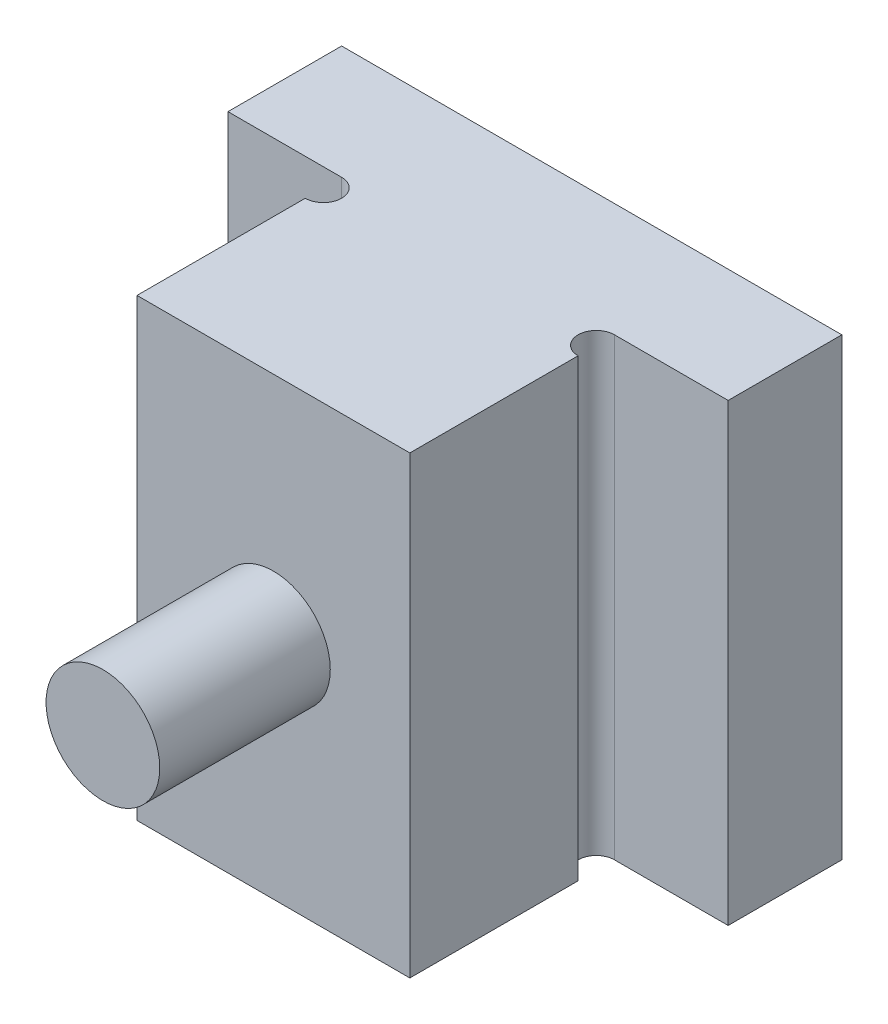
ISO-10303-21;
HEADER;
FILE_DESCRIPTION(('STEP AP214'),'2;1');
FILE_NAME('part.step','',(''),(''),'','','');
FILE_SCHEMA(('AUTOMOTIVE_DESIGN { 1 0 10303 214 1 1 1 1 }'));
ENDSEC;
DATA;
#1=APPLICATION_CONTEXT('core data for automotive mechanical design processes');
#2=APPLICATION_PROTOCOL_DEFINITION('international standard','automotive_design',2000,#1);
#3=PRODUCT_CONTEXT('',#1,'mechanical');
#4=PRODUCT('Part','Part','',(#3));
#5=PRODUCT_RELATED_PRODUCT_CATEGORY('part','',(#4));
#6=PRODUCT_DEFINITION_FORMATION('','',#4);
#7=PRODUCT_DEFINITION_CONTEXT('part definition',#1,'design');
#8=PRODUCT_DEFINITION('design','',#6,#7);
#9=PRODUCT_DEFINITION_SHAPE('','',#8);
#10=(LENGTH_UNIT() NAMED_UNIT(*) SI_UNIT(.MILLI.,.METRE.));
#11=(NAMED_UNIT(*) PLANE_ANGLE_UNIT() SI_UNIT($,.RADIAN.));
#12=(NAMED_UNIT(*) SI_UNIT($,.STERADIAN.) SOLID_ANGLE_UNIT());
#13=UNCERTAINTY_MEASURE_WITH_UNIT(LENGTH_MEASURE(1.E-05),#10,'distance_accuracy_value','');
#14=(GEOMETRIC_REPRESENTATION_CONTEXT(3) GLOBAL_UNCERTAINTY_ASSIGNED_CONTEXT((#13)) GLOBAL_UNIT_ASSIGNED_CONTEXT((#10,
#11,#12)) REPRESENTATION_CONTEXT('',''));
#15=CARTESIAN_POINT('',(0.,0.,0.));
#16=DIRECTION('',(0.,0.,1.));
#17=DIRECTION('',(1.,0.,0.));
#18=AXIS2_PLACEMENT_3D('',#15,#16,#17);
#19=CARTESIAN_POINT('',(-1.15470053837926,2.,-9.95));
#20=DIRECTION('',(0.,0.,1.));
#21=DIRECTION('',(-1.,0.,0.));
#22=AXIS2_PLACEMENT_3D('',#19,#20,#21);
#23=PLANE('',#22);
#24=DIRECTION('',(1.,0.,0.));
#25=VECTOR('',#24,1.);
#26=CARTESIAN_POINT('',(-1.15470053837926,2.,-9.95));
#27=LINE('',#26,#25);
#28=CARTESIAN_POINT('',(-1.15470053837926,2.,-9.95));
#29=VERTEX_POINT('',#28);
#30=CARTESIAN_POINT('',(1.15470053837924,2.,-9.95));
#31=VERTEX_POINT('',#30);
#32=EDGE_CURVE('E127',#29,#31,#27,.T.);
#33=ORIENTED_EDGE('',*,*,#32,.T.);
#34=DIRECTION('',(0.5,-0.866025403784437,0.));
#35=VECTOR('',#34,1.);
#36=CARTESIAN_POINT('',(1.15470053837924,2.,-9.95));
#37=LINE('',#36,#35);
#38=CARTESIAN_POINT('',(2.3094010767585,0.,-9.95));
#39=VERTEX_POINT('',#38);
#40=EDGE_CURVE('E132',#31,#39,#37,.T.);
#41=ORIENTED_EDGE('',*,*,#40,.T.);
#42=DIRECTION('',(0.5,0.866025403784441,0.));
#43=VECTOR('',#42,1.);
#44=CARTESIAN_POINT('',(1.15470053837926,-2.,-9.95));
#45=LINE('',#44,#43);
#46=CARTESIAN_POINT('',(1.15470053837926,-2.,-9.95));
#47=VERTEX_POINT('',#46);
#48=EDGE_CURVE('E183',#47,#39,#45,.T.);
#49=ORIENTED_EDGE('',*,*,#48,.F.);
#50=DIRECTION('',(1.,0.,0.));
#51=VECTOR('',#50,1.);
#52=CARTESIAN_POINT('',(-1.15470053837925,-2.,-9.95));
#53=LINE('',#52,#51);
#54=CARTESIAN_POINT('',(-1.15470053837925,-2.,-9.95));
#55=VERTEX_POINT('',#54);
#56=EDGE_CURVE('E148',#55,#47,#53,.T.);
#57=ORIENTED_EDGE('',*,*,#56,.F.);
#58=DIRECTION('',(-0.5,0.866025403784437,0.));
#59=VECTOR('',#58,1.);
#60=CARTESIAN_POINT('',(-1.15470053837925,-2.,-9.95));
#61=LINE('',#60,#59);
#62=CARTESIAN_POINT('',(-2.30940107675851,0.,-9.95));
#63=VERTEX_POINT('',#62);
#64=EDGE_CURVE('E143',#55,#63,#61,.T.);
#65=ORIENTED_EDGE('',*,*,#64,.T.);
#66=DIRECTION('',(-0.5,-0.866025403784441,0.));
#67=VECTOR('',#66,1.);
#68=CARTESIAN_POINT('',(-1.15470053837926,2.,-9.95));
#69=LINE('',#68,#67);
#70=EDGE_CURVE('E145',#29,#63,#69,.T.);
#71=ORIENTED_EDGE('',*,*,#70,.F.);
#72=EDGE_LOOP('',(#33,#41,#49,#57,#65,#71));
#73=FACE_BOUND('',#72,.T.);
#74=ADVANCED_FACE('F16',(#73),#23,.F.);
#75=CARTESIAN_POINT('',(-1.15470053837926,2.,-9.95));
#76=DIRECTION('',(0.866025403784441,-0.5,0.));
#77=DIRECTION('',(-0.5,-0.866025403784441,0.));
#78=AXIS2_PLACEMENT_3D('',#75,#76,#77);
#79=PLANE('',#78);
#80=ORIENTED_EDGE('',*,*,#70,.T.);
#81=DIRECTION('',(0.,0.,-1.));
#82=VECTOR('',#81,1.);
#83=CARTESIAN_POINT('',(-2.30940107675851,0.,-9.95));
#84=LINE('',#83,#82);
#85=CARTESIAN_POINT('',(-2.30940107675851,0.,-13.5));
#86=VERTEX_POINT('',#85);
#87=EDGE_CURVE('E154',#63,#86,#84,.T.);
#88=ORIENTED_EDGE('',*,*,#87,.T.);
#89=DIRECTION('',(0.5,0.86602540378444,0.));
#90=VECTOR('',#89,1.);
#91=CARTESIAN_POINT('',(-2.30940107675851,0.,-13.5));
#92=LINE('',#91,#90);
#93=CARTESIAN_POINT('',(-1.15470053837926,2.,-13.5));
#94=VERTEX_POINT('',#93);
#95=EDGE_CURVE('E199',#86,#94,#92,.T.);
#96=ORIENTED_EDGE('',*,*,#95,.T.);
#97=DIRECTION('',(0.,0.,-1.));
#98=VECTOR('',#97,1.);
#99=CARTESIAN_POINT('',(-1.15470053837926,2.,-9.95));
#100=LINE('',#99,#98);
#101=EDGE_CURVE('E151',#94,#29,#100,.F.);
#102=ORIENTED_EDGE('',*,*,#101,.T.);
#103=EDGE_LOOP('',(#80,#88,#96,#102));
#104=FACE_BOUND('',#103,.T.);
#105=ADVANCED_FACE('F162',(#104),#79,.T.);
#106=CARTESIAN_POINT('',(-1.15470053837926,2.,-9.95));
#107=DIRECTION('',(0.,1.,0.));
#108=DIRECTION('',(1.,0.,0.));
#109=AXIS2_PLACEMENT_3D('',#106,#107,#108);
#110=PLANE('',#109);
#111=DIRECTION('',(0.,0.,-1.));
#112=VECTOR('',#111,1.);
#113=CARTESIAN_POINT('',(1.15470053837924,2.,-9.95));
#114=LINE('',#113,#112);
#115=CARTESIAN_POINT('',(1.15470053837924,2.,-13.5));
#116=VERTEX_POINT('',#115);
#117=EDGE_CURVE('E189',#116,#31,#114,.F.);
#118=ORIENTED_EDGE('',*,*,#117,.T.);
#119=ORIENTED_EDGE('',*,*,#32,.F.);
#120=ORIENTED_EDGE('',*,*,#101,.F.);
#121=DIRECTION('',(-1.,0.,0.));
#122=VECTOR('',#121,1.);
#123=CARTESIAN_POINT('',(0.,2.,-13.5));
#124=LINE('',#123,#122);
#125=EDGE_CURVE('E160',#94,#116,#124,.F.);
#126=ORIENTED_EDGE('',*,*,#125,.T.);
#127=EDGE_LOOP('',(#118,#119,#120,#126));
#128=FACE_BOUND('',#127,.T.);
#129=ADVANCED_FACE('F344',(#128),#110,.F.);
#130=CARTESIAN_POINT('',(1.15470053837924,2.,-9.95));
#131=DIRECTION('',(0.866025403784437,0.5,0.));
#132=DIRECTION('',(0.5,-0.866025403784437,0.));
#133=AXIS2_PLACEMENT_3D('',#130,#131,#132);
#134=PLANE('',#133);
#135=DIRECTION('',(0.,0.,-1.));
#136=VECTOR('',#135,1.);
#137=CARTESIAN_POINT('',(2.3094010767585,0.,-9.95));
#138=LINE('',#137,#136);
#139=CARTESIAN_POINT('',(2.3094010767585,0.,-13.5));
#140=VERTEX_POINT('',#139);
#141=EDGE_CURVE('E179',#39,#140,#138,.T.);
#142=ORIENTED_EDGE('',*,*,#141,.F.);
#143=ORIENTED_EDGE('',*,*,#40,.F.);
#144=ORIENTED_EDGE('',*,*,#117,.F.);
#145=DIRECTION('',(0.5,-0.866025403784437,0.));
#146=VECTOR('',#145,1.);
#147=CARTESIAN_POINT('',(1.15470053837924,2.,-13.5));
#148=LINE('',#147,#146);
#149=EDGE_CURVE('E648',#116,#140,#148,.T.);
#150=ORIENTED_EDGE('',*,*,#149,.T.);
#151=EDGE_LOOP('',(#142,#143,#144,#150));
#152=FACE_BOUND('',#151,.T.);
#153=ADVANCED_FACE('F524',(#152),#134,.F.);
#154=CARTESIAN_POINT('',(1.15470053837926,-2.,-9.95));
#155=DIRECTION('',(-0.866025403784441,0.5,0.));
#156=DIRECTION('',(0.5,0.866025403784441,0.));
#157=AXIS2_PLACEMENT_3D('',#154,#155,#156);
#158=PLANE('',#157);
#159=ORIENTED_EDGE('',*,*,#48,.T.);
#160=ORIENTED_EDGE('',*,*,#141,.T.);
#161=DIRECTION('',(-0.5,-0.866025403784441,0.));
#162=VECTOR('',#161,1.);
#163=CARTESIAN_POINT('',(2.3094010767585,0.,-13.5));
#164=LINE('',#163,#162);
#165=CARTESIAN_POINT('',(1.15470053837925,-2.,-13.5));
#166=VERTEX_POINT('',#165);
#167=EDGE_CURVE('E643',#140,#166,#164,.T.);
#168=ORIENTED_EDGE('',*,*,#167,.T.);
#169=DIRECTION('',(0.,0.,-1.));
#170=VECTOR('',#169,1.);
#171=CARTESIAN_POINT('',(1.15470053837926,-2.,-9.95));
#172=LINE('',#171,#170);
#173=EDGE_CURVE('E173',#47,#166,#172,.T.);
#174=ORIENTED_EDGE('',*,*,#173,.F.);
#175=EDGE_LOOP('',(#159,#160,#168,#174));
#176=FACE_BOUND('',#175,.T.);
#177=ADVANCED_FACE('F536',(#176),#158,.T.);
#178=CARTESIAN_POINT('',(-1.15470053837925,-2.,-9.95));
#179=DIRECTION('',(0.,1.,0.));
#180=DIRECTION('',(1.,0.,0.));
#181=AXIS2_PLACEMENT_3D('',#178,#179,#180);
#182=PLANE('',#181);
#183=ORIENTED_EDGE('',*,*,#56,.T.);
#184=ORIENTED_EDGE('',*,*,#173,.T.);
#185=DIRECTION('',(-1.,0.,0.));
#186=VECTOR('',#185,1.);
#187=CARTESIAN_POINT('',(0.,-2.,-13.5));
#188=LINE('',#187,#186);
#189=CARTESIAN_POINT('',(-1.15470053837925,-2.,-13.5));
#190=VERTEX_POINT('',#189);
#191=EDGE_CURVE('E633',#166,#190,#188,.T.);
#192=ORIENTED_EDGE('',*,*,#191,.T.);
#193=DIRECTION('',(0.,0.,-1.));
#194=VECTOR('',#193,1.);
#195=CARTESIAN_POINT('',(-1.15470053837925,-2.,-9.95));
#196=LINE('',#195,#194);
#197=EDGE_CURVE('E152',#190,#55,#196,.F.);
#198=ORIENTED_EDGE('',*,*,#197,.T.);
#199=EDGE_LOOP('',(#183,#184,#192,#198));
#200=FACE_BOUND('',#199,.T.);
#201=ADVANCED_FACE('F546',(#200),#182,.T.);
#202=CARTESIAN_POINT('',(-1.15470053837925,-2.,-9.95));
#203=DIRECTION('',(-0.866025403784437,-0.5,0.));
#204=DIRECTION('',(-0.5,0.866025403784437,0.));
#205=AXIS2_PLACEMENT_3D('',#202,#203,#204);
#206=PLANE('',#205);
#207=ORIENTED_EDGE('',*,*,#87,.F.);
#208=ORIENTED_EDGE('',*,*,#64,.F.);
#209=ORIENTED_EDGE('',*,*,#197,.F.);
#210=DIRECTION('',(-0.5,0.866025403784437,0.));
#211=VECTOR('',#210,1.);
#212=CARTESIAN_POINT('',(-1.15470053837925,-2.,-13.5));
#213=LINE('',#212,#211);
#214=EDGE_CURVE('E36',#190,#86,#213,.T.);
#215=ORIENTED_EDGE('',*,*,#214,.T.);
#216=EDGE_LOOP('',(#207,#208,#209,#215));
#217=FACE_BOUND('',#216,.T.);
#218=ADVANCED_FACE('F155',(#217),#206,.F.);
#219=CARTESIAN_POINT('',(0.,-4.05,-13.5));
#220=DIRECTION('',(0.,0.,1.));
#221=DIRECTION('',(-1.,0.,0.));
#222=AXIS2_PLACEMENT_3D('',#219,#220,#221);
#223=PLANE('',#222);
#224=CARTESIAN_POINT('',(0.,0.,-13.5));
#225=DIRECTION('',(0.,0.,1.));
#226=DIRECTION('',(-1.,0.,0.));
#227=AXIS2_PLACEMENT_3D('',#224,#225,#226);
#228=CIRCLE('',#227,4.25);
#229=CARTESIAN_POINT('',(-4.25,0.,-13.5));
#230=VERTEX_POINT('',#229);
#231=EDGE_CURVE('E198',#230,#230,#228,.T.);
#232=ORIENTED_EDGE('',*,*,#231,.F.);
#233=EDGE_LOOP('',(#232));
#234=FACE_BOUND('',#233,.T.);
#235=ORIENTED_EDGE('',*,*,#214,.F.);
#236=ORIENTED_EDGE('',*,*,#191,.F.);
#237=ORIENTED_EDGE('',*,*,#167,.F.);
#238=ORIENTED_EDGE('',*,*,#149,.F.);
#239=ORIENTED_EDGE('',*,*,#125,.F.);
#240=ORIENTED_EDGE('',*,*,#95,.F.);
#241=EDGE_LOOP('',(#235,#236,#237,#238,#239,#240));
#242=FACE_BOUND('',#241,.T.);
#243=ADVANCED_FACE('F349',(#234,#242),#223,.F.);
#244=CARTESIAN_POINT('',(0.,0.,-8.5));
#245=DIRECTION('',(0.,0.,-1.));
#246=DIRECTION('',(1.,0.,0.));
#247=AXIS2_PLACEMENT_3D('',#244,#245,#246);
#248=CYLINDRICAL_SURFACE('',#247,4.25);
#249=CARTESIAN_POINT('',(0.,0.,-8.5));
#250=DIRECTION('',(0.,0.,-1.));
#251=DIRECTION('',(1.,0.,0.));
#252=AXIS2_PLACEMENT_3D('',#249,#250,#251);
#253=CIRCLE('',#252,4.25);
#254=CARTESIAN_POINT('',(4.25,0.,-8.5));
#255=VERTEX_POINT('',#254);
#256=EDGE_CURVE('E194',#255,#255,#253,.T.);
#257=ORIENTED_EDGE('',*,*,#256,.T.);
#258=EDGE_LOOP('',(#257));
#259=FACE_BOUND('',#258,.T.);
#260=ORIENTED_EDGE('',*,*,#231,.T.);
#261=EDGE_LOOP('',(#260));
#262=FACE_BOUND('',#261,.T.);
#263=ADVANCED_FACE('F352',(#259,#262),#248,.T.);
#264=CARTESIAN_POINT('',(6.,10.,-8.2));
#265=DIRECTION('',(0.,-1.,0.));
#266=DIRECTION('',(-1.,0.,0.));
#267=AXIS2_PLACEMENT_3D('',#264,#265,#266);
#268=CYLINDRICAL_SURFACE('',#267,0.8);
#269=CARTESIAN_POINT('',(6.,10.,-8.2));
#270=DIRECTION('',(0.,-1.,0.));
#271=DIRECTION('',(-1.,0.,0.));
#272=AXIS2_PLACEMENT_3D('',#269,#270,#271);
#273=CIRCLE('',#272,0.8);
#274=CARTESIAN_POINT('',(6.,10.,-7.4));
#275=VERTEX_POINT('',#274);
#276=CARTESIAN_POINT('',(6.,10.,-9.));
#277=VERTEX_POINT('',#276);
#278=EDGE_CURVE('E283',#275,#277,#273,.T.);
#279=ORIENTED_EDGE('',*,*,#278,.F.);
#280=DIRECTION('',(0.,1.,0.));
#281=VECTOR('',#280,1.);
#282=CARTESIAN_POINT('',(6.,-10.,-7.4));
#283=LINE('',#282,#281);
#284=CARTESIAN_POINT('',(6.,-10.,-7.4));
#285=VERTEX_POINT('',#284);
#286=EDGE_CURVE('E278',#275,#285,#283,.F.);
#287=ORIENTED_EDGE('',*,*,#286,.T.);
#288=CARTESIAN_POINT('',(6.,-10.,-8.2));
#289=DIRECTION('',(0.,-1.,0.));
#290=DIRECTION('',(-1.,0.,0.));
#291=AXIS2_PLACEMENT_3D('',#288,#289,#290);
#292=CIRCLE('',#291,0.8);
#293=CARTESIAN_POINT('',(6.,-10.,-9.));
#294=VERTEX_POINT('',#293);
#295=EDGE_CURVE('E282',#294,#285,#292,.F.);
#296=ORIENTED_EDGE('',*,*,#295,.F.);
#297=DIRECTION('',(0.,-1.,0.));
#298=VECTOR('',#297,1.);
#299=CARTESIAN_POINT('',(6.,10.,-9.));
#300=LINE('',#299,#298);
#301=EDGE_CURVE('E229',#294,#277,#300,.F.);
#302=ORIENTED_EDGE('',*,*,#301,.T.);
#303=EDGE_LOOP('',(#279,#287,#296,#302));
#304=FACE_BOUND('',#303,.T.);
#305=ADVANCED_FACE('F356',(#304),#268,.F.);
#306=CARTESIAN_POINT('',(6.,10.,-9.));
#307=DIRECTION('',(0.,0.,-1.));
#308=DIRECTION('',(1.,0.,0.));
#309=AXIS2_PLACEMENT_3D('',#306,#307,#308);
#310=PLANE('',#309);
#311=DIRECTION('',(1.,0.,0.));
#312=VECTOR('',#311,1.);
#313=CARTESIAN_POINT('',(6.,10.,-9.));
#314=LINE('',#313,#312);
#315=CARTESIAN_POINT('',(11.,10.,-9.));
#316=VERTEX_POINT('',#315);
#317=EDGE_CURVE('E220',#277,#316,#314,.T.);
#318=ORIENTED_EDGE('',*,*,#317,.F.);
#319=ORIENTED_EDGE('',*,*,#301,.F.);
#320=DIRECTION('',(1.,0.,0.));
#321=VECTOR('',#320,1.);
#322=CARTESIAN_POINT('',(6.,-10.,-9.));
#323=LINE('',#322,#321);
#324=CARTESIAN_POINT('',(11.,-10.,-9.));
#325=VERTEX_POINT('',#324);
#326=EDGE_CURVE('E211',#294,#325,#323,.T.);
#327=ORIENTED_EDGE('',*,*,#326,.T.);
#328=DIRECTION('',(0.,1.,0.));
#329=VECTOR('',#328,1.);
#330=CARTESIAN_POINT('',(11.,-10.,-9.));
#331=LINE('',#330,#329);
#332=EDGE_CURVE('E223',#325,#316,#331,.T.);
#333=ORIENTED_EDGE('',*,*,#332,.T.);
#334=EDGE_LOOP('',(#318,#319,#327,#333));
#335=FACE_BOUND('',#334,.T.);
#336=ADVANCED_FACE('F372',(#335),#310,.F.);
#337=CARTESIAN_POINT('',(11.,-10.,-14.));
#338=DIRECTION('',(-1.,0.,0.));
#339=DIRECTION('',(0.,1.,0.));
#340=AXIS2_PLACEMENT_3D('',#337,#338,#339);
#341=PLANE('',#340);
#342=DIRECTION('',(0.,0.,1.));
#343=VECTOR('',#342,1.);
#344=CARTESIAN_POINT('',(11.,-10.,-14.));
#345=LINE('',#344,#343);
#346=CARTESIAN_POINT('',(11.,-10.,-14.));
#347=VERTEX_POINT('',#346);
#348=EDGE_CURVE('E265',#325,#347,#345,.F.);
#349=ORIENTED_EDGE('',*,*,#348,.T.);
#350=DIRECTION('',(0.,1.,0.));
#351=VECTOR('',#350,1.);
#352=CARTESIAN_POINT('',(11.,-10.,-14.));
#353=LINE('',#352,#351);
#354=CARTESIAN_POINT('',(11.,10.,-14.));
#355=VERTEX_POINT('',#354);
#356=EDGE_CURVE('E297',#347,#355,#353,.T.);
#357=ORIENTED_EDGE('',*,*,#356,.T.);
#358=DIRECTION('',(0.,0.,-1.));
#359=VECTOR('',#358,1.);
#360=CARTESIAN_POINT('',(11.,10.,-14.));
#361=LINE('',#360,#359);
#362=EDGE_CURVE('E251',#316,#355,#361,.T.);
#363=ORIENTED_EDGE('',*,*,#362,.F.);
#364=ORIENTED_EDGE('',*,*,#332,.F.);
#365=EDGE_LOOP('',(#349,#357,#363,#364));
#366=FACE_BOUND('',#365,.T.);
#367=ADVANCED_FACE('F335',(#366),#341,.F.);
#368=CARTESIAN_POINT('',(11.,-10.,-14.));
#369=DIRECTION('',(0.,0.,1.));
#370=DIRECTION('',(-1.,0.,0.));
#371=AXIS2_PLACEMENT_3D('',#368,#369,#370);
#372=PLANE('',#371);
#373=DIRECTION('',(0.,-1.,0.));
#374=VECTOR('',#373,1.);
#375=CARTESIAN_POINT('',(-11.,-10.,-14.));
#376=LINE('',#375,#374);
#377=CARTESIAN_POINT('',(-11.,10.,-14.));
#378=VERTEX_POINT('',#377);
#379=CARTESIAN_POINT('',(-11.,-10.,-14.));
#380=VERTEX_POINT('',#379);
#381=EDGE_CURVE('E307',#378,#380,#376,.T.);
#382=ORIENTED_EDGE('',*,*,#381,.F.);
#383=DIRECTION('',(1.,0.,0.));
#384=VECTOR('',#383,1.);
#385=CARTESIAN_POINT('',(6.,10.,-14.));
#386=LINE('',#385,#384);
#387=EDGE_CURVE('E269',#378,#355,#386,.T.);
#388=ORIENTED_EDGE('',*,*,#387,.T.);
#389=ORIENTED_EDGE('',*,*,#356,.F.);
#390=DIRECTION('',(1.,0.,0.));
#391=VECTOR('',#390,1.);
#392=CARTESIAN_POINT('',(6.,-10.,-14.));
#393=LINE('',#392,#391);
#394=EDGE_CURVE('E300',#380,#347,#393,.T.);
#395=ORIENTED_EDGE('',*,*,#394,.F.);
#396=EDGE_LOOP('',(#382,#388,#389,#395));
#397=FACE_BOUND('',#396,.T.);
#398=CARTESIAN_POINT('',(0.,0.,-14.));
#399=DIRECTION('',(0.,0.,1.));
#400=DIRECTION('',(-1.,0.,0.));
#401=AXIS2_PLACEMENT_3D('',#398,#399,#400);
#402=CIRCLE('',#401,5.);
#403=CARTESIAN_POINT('',(-5.,0.,-14.));
#404=VERTEX_POINT('',#403);
#405=EDGE_CURVE('E20',#404,#404,#402,.T.);
#406=ORIENTED_EDGE('',*,*,#405,.T.);
#407=EDGE_LOOP('',(#406));
#408=FACE_BOUND('',#407,.T.);
#409=ADVANCED_FACE('F322',(#397,#408),#372,.F.);
#410=CARTESIAN_POINT('',(0.,0.,-14.));
#411=DIRECTION('',(0.,0.,-1.));
#412=DIRECTION('',(1.,0.,0.));
#413=AXIS2_PLACEMENT_3D('',#410,#411,#412);
#414=CYLINDRICAL_SURFACE('',#413,5.);
#415=CARTESIAN_POINT('',(0.,0.,-8.5));
#416=DIRECTION('',(0.,0.,-1.));
#417=DIRECTION('',(1.,0.,0.));
#418=AXIS2_PLACEMENT_3D('',#415,#416,#417);
#419=CIRCLE('',#418,5.);
#420=CARTESIAN_POINT('',(5.,0.,-8.5));
#421=VERTEX_POINT('',#420);
#422=EDGE_CURVE('E228',#421,#421,#419,.T.);
#423=ORIENTED_EDGE('',*,*,#422,.F.);
#424=EDGE_LOOP('',(#423));
#425=FACE_BOUND('',#424,.T.);
#426=ORIENTED_EDGE('',*,*,#405,.F.);
#427=EDGE_LOOP('',(#426));
#428=FACE_BOUND('',#427,.T.);
#429=ADVANCED_FACE('F18',(#425,#428),#414,.F.);
#430=CARTESIAN_POINT('',(0.,-5.,-8.5));
#431=DIRECTION('',(0.,0.,1.));
#432=DIRECTION('',(-1.,0.,0.));
#433=AXIS2_PLACEMENT_3D('',#430,#431,#432);
#434=PLANE('',#433);
#435=ORIENTED_EDGE('',*,*,#256,.F.);
#436=EDGE_LOOP('',(#435));
#437=FACE_BOUND('',#436,.T.);
#438=ORIENTED_EDGE('',*,*,#422,.T.);
#439=EDGE_LOOP('',(#438));
#440=FACE_BOUND('',#439,.T.);
#441=ADVANCED_FACE('F325',(#437,#440),#434,.F.);
#442=CARTESIAN_POINT('',(-11.,-10.,-14.));
#443=DIRECTION('',(1.,0.,0.));
#444=DIRECTION('',(0.,-1.,0.));
#445=AXIS2_PLACEMENT_3D('',#442,#443,#444);
#446=PLANE('',#445);
#447=DIRECTION('',(0.,0.,-1.));
#448=VECTOR('',#447,1.);
#449=CARTESIAN_POINT('',(-11.,10.,-14.));
#450=LINE('',#449,#448);
#451=CARTESIAN_POINT('',(-11.,10.,-9.));
#452=VERTEX_POINT('',#451);
#453=EDGE_CURVE('E261',#452,#378,#450,.T.);
#454=ORIENTED_EDGE('',*,*,#453,.T.);
#455=ORIENTED_EDGE('',*,*,#381,.T.);
#456=DIRECTION('',(0.,0.,1.));
#457=VECTOR('',#456,1.);
#458=CARTESIAN_POINT('',(-11.,-10.,-14.));
#459=LINE('',#458,#457);
#460=CARTESIAN_POINT('',(-11.,-10.,-9.));
#461=VERTEX_POINT('',#460);
#462=EDGE_CURVE('E247',#461,#380,#459,.F.);
#463=ORIENTED_EDGE('',*,*,#462,.F.);
#464=DIRECTION('',(0.,-1.,0.));
#465=VECTOR('',#464,1.);
#466=CARTESIAN_POINT('',(-11.,-10.,-9.));
#467=LINE('',#466,#465);
#468=EDGE_CURVE('E215',#452,#461,#467,.T.);
#469=ORIENTED_EDGE('',*,*,#468,.F.);
#470=EDGE_LOOP('',(#454,#455,#463,#469));
#471=FACE_BOUND('',#470,.T.);
#472=ADVANCED_FACE('F332',(#471),#446,.F.);
#473=CARTESIAN_POINT('',(-12.,10.,-9.));
#474=DIRECTION('',(0.,0.,-1.));
#475=DIRECTION('',(1.,0.,0.));
#476=AXIS2_PLACEMENT_3D('',#473,#474,#475);
#477=PLANE('',#476);
#478=ORIENTED_EDGE('',*,*,#468,.T.);
#479=DIRECTION('',(1.,0.,0.));
#480=VECTOR('',#479,1.);
#481=CARTESIAN_POINT('',(6.,-10.,-9.));
#482=LINE('',#481,#480);
#483=CARTESIAN_POINT('',(-6.,-10.,-9.));
#484=VERTEX_POINT('',#483);
#485=EDGE_CURVE('E206',#461,#484,#482,.T.);
#486=ORIENTED_EDGE('',*,*,#485,.T.);
#487=DIRECTION('',(0.,-1.,0.));
#488=VECTOR('',#487,1.);
#489=CARTESIAN_POINT('',(-6.,10.,-9.));
#490=LINE('',#489,#488);
#491=CARTESIAN_POINT('',(-6.,10.,-9.));
#492=VERTEX_POINT('',#491);
#493=EDGE_CURVE('E224',#492,#484,#490,.T.);
#494=ORIENTED_EDGE('',*,*,#493,.F.);
#495=DIRECTION('',(1.,0.,0.));
#496=VECTOR('',#495,1.);
#497=CARTESIAN_POINT('',(6.,10.,-9.));
#498=LINE('',#497,#496);
#499=EDGE_CURVE('E216',#452,#492,#498,.T.);
#500=ORIENTED_EDGE('',*,*,#499,.F.);
#501=EDGE_LOOP('',(#478,#486,#494,#500));
#502=FACE_BOUND('',#501,.T.);
#503=ADVANCED_FACE('F367',(#502),#477,.F.);
#504=CARTESIAN_POINT('',(-6.,10.,-8.2));
#505=DIRECTION('',(0.,-1.,0.));
#506=DIRECTION('',(-1.,0.,0.));
#507=AXIS2_PLACEMENT_3D('',#504,#505,#506);
#508=CYLINDRICAL_SURFACE('',#507,0.8);
#509=CARTESIAN_POINT('',(-6.,10.,-8.2));
#510=DIRECTION('',(0.,-1.,0.));
#511=DIRECTION('',(-1.,0.,0.));
#512=AXIS2_PLACEMENT_3D('',#509,#510,#511);
#513=CIRCLE('',#512,0.8);
#514=CARTESIAN_POINT('',(-6.,10.,-7.4));
#515=VERTEX_POINT('',#514);
#516=EDGE_CURVE('E273',#492,#515,#513,.T.);
#517=ORIENTED_EDGE('',*,*,#516,.F.);
#518=ORIENTED_EDGE('',*,*,#493,.T.);
#519=CARTESIAN_POINT('',(-6.,-10.,-8.2));
#520=DIRECTION('',(0.,-1.,0.));
#521=DIRECTION('',(-1.,0.,0.));
#522=AXIS2_PLACEMENT_3D('',#519,#520,#521);
#523=CIRCLE('',#522,0.8);
#524=CARTESIAN_POINT('',(-6.,-10.,-7.4));
#525=VERTEX_POINT('',#524);
#526=EDGE_CURVE('E277',#525,#484,#523,.F.);
#527=ORIENTED_EDGE('',*,*,#526,.F.);
#528=DIRECTION('',(0.,-1.,0.));
#529=VECTOR('',#528,1.);
#530=CARTESIAN_POINT('',(-6.,-10.,-7.4));
#531=LINE('',#530,#529);
#532=EDGE_CURVE('E233',#525,#515,#531,.F.);
#533=ORIENTED_EDGE('',*,*,#532,.T.);
#534=EDGE_LOOP('',(#517,#518,#527,#533));
#535=FACE_BOUND('',#534,.T.);
#536=ADVANCED_FACE('F370',(#535),#508,.F.);
#537=CARTESIAN_POINT('',(6.,10.,-14.));
#538=DIRECTION('',(0.,1.,0.));
#539=DIRECTION('',(1.,0.,0.));
#540=AXIS2_PLACEMENT_3D('',#537,#538,#539);
#541=PLANE('',#540);
#542=DIRECTION('',(-1.,0.,0.));
#543=VECTOR('',#542,1.);
#544=CARTESIAN_POINT('',(6.,10.,0.));
#545=LINE('',#544,#543);
#546=CARTESIAN_POINT('',(6.,10.,0.));
#547=VERTEX_POINT('',#546);
#548=CARTESIAN_POINT('',(-6.,10.,0.));
#549=VERTEX_POINT('',#548);
#550=EDGE_CURVE('E294',#547,#549,#545,.T.);
#551=ORIENTED_EDGE('',*,*,#550,.F.);
#552=DIRECTION('',(0.,0.,-1.));
#553=VECTOR('',#552,1.);
#554=CARTESIAN_POINT('',(6.,10.,0.));
#555=LINE('',#554,#553);
#556=EDGE_CURVE('E255',#547,#275,#555,.T.);
#557=ORIENTED_EDGE('',*,*,#556,.T.);
#558=ORIENTED_EDGE('',*,*,#278,.T.);
#559=ORIENTED_EDGE('',*,*,#317,.T.);
#560=ORIENTED_EDGE('',*,*,#362,.T.);
#561=ORIENTED_EDGE('',*,*,#387,.F.);
#562=ORIENTED_EDGE('',*,*,#453,.F.);
#563=ORIENTED_EDGE('',*,*,#499,.T.);
#564=ORIENTED_EDGE('',*,*,#516,.T.);
#565=DIRECTION('',(0.,0.,-1.));
#566=VECTOR('',#565,1.);
#567=CARTESIAN_POINT('',(-6.,10.,-14.));
#568=LINE('',#567,#566);
#569=EDGE_CURVE('E258',#549,#515,#568,.T.);
#570=ORIENTED_EDGE('',*,*,#569,.F.);
#571=EDGE_LOOP('',(#551,#557,#558,#559,#560,#561,#562,#563,#564,#570));
#572=FACE_BOUND('',#571,.T.);
#573=ADVANCED_FACE('F378',(#572),#541,.T.);
#574=CARTESIAN_POINT('',(6.,-10.,0.));
#575=DIRECTION('',(-1.,0.,0.));
#576=DIRECTION('',(0.,1.,0.));
#577=AXIS2_PLACEMENT_3D('',#574,#575,#576);
#578=PLANE('',#577);
#579=ORIENTED_EDGE('',*,*,#556,.F.);
#580=DIRECTION('',(0.,-1.,0.));
#581=VECTOR('',#580,1.);
#582=CARTESIAN_POINT('',(6.,-10.,0.));
#583=LINE('',#582,#581);
#584=CARTESIAN_POINT('',(6.,-10.,0.));
#585=VERTEX_POINT('',#584);
#586=EDGE_CURVE('E114',#547,#585,#583,.T.);
#587=ORIENTED_EDGE('',*,*,#586,.T.);
#588=DIRECTION('',(0.,0.,1.));
#589=VECTOR('',#588,1.);
#590=CARTESIAN_POINT('',(6.,-10.,-14.));
#591=LINE('',#590,#589);
#592=EDGE_CURVE('E210',#585,#285,#591,.F.);
#593=ORIENTED_EDGE('',*,*,#592,.T.);
#594=ORIENTED_EDGE('',*,*,#286,.F.);
#595=EDGE_LOOP('',(#579,#587,#593,#594));
#596=FACE_BOUND('',#595,.T.);
#597=ADVANCED_FACE('F395',(#596),#578,.F.);
#598=CARTESIAN_POINT('',(6.,-10.,-14.));
#599=DIRECTION('',(0.,1.,0.));
#600=DIRECTION('',(1.,0.,0.));
#601=AXIS2_PLACEMENT_3D('',#598,#599,#600);
#602=PLANE('',#601);
#603=ORIENTED_EDGE('',*,*,#592,.F.);
#604=DIRECTION('',(-1.,0.,0.));
#605=VECTOR('',#604,1.);
#606=CARTESIAN_POINT('',(6.,-10.,0.));
#607=LINE('',#606,#605);
#608=CARTESIAN_POINT('',(-6.,-10.,0.));
#609=VERTEX_POINT('',#608);
#610=EDGE_CURVE('E304',#585,#609,#607,.T.);
#611=ORIENTED_EDGE('',*,*,#610,.T.);
#612=DIRECTION('',(0.,0.,1.));
#613=VECTOR('',#612,1.);
#614=CARTESIAN_POINT('',(-6.,-10.,0.));
#615=LINE('',#614,#613);
#616=EDGE_CURVE('E244',#609,#525,#615,.F.);
#617=ORIENTED_EDGE('',*,*,#616,.T.);
#618=ORIENTED_EDGE('',*,*,#526,.T.);
#619=ORIENTED_EDGE('',*,*,#485,.F.);
#620=ORIENTED_EDGE('',*,*,#462,.T.);
#621=ORIENTED_EDGE('',*,*,#394,.T.);
#622=ORIENTED_EDGE('',*,*,#348,.F.);
#623=ORIENTED_EDGE('',*,*,#326,.F.);
#624=ORIENTED_EDGE('',*,*,#295,.T.);
#625=EDGE_LOOP('',(#603,#611,#617,#618,#619,#620,#621,#622,#623,#624));
#626=FACE_BOUND('',#625,.T.);
#627=ADVANCED_FACE('F392',(#626),#602,.F.);
#628=CARTESIAN_POINT('',(-6.,-10.,0.));
#629=DIRECTION('',(1.,0.,0.));
#630=DIRECTION('',(0.,0.,1.));
#631=AXIS2_PLACEMENT_3D('',#628,#629,#630);
#632=PLANE('',#631);
#633=ORIENTED_EDGE('',*,*,#616,.F.);
#634=DIRECTION('',(0.,1.,0.));
#635=VECTOR('',#634,1.);
#636=CARTESIAN_POINT('',(-6.,-10.,0.));
#637=LINE('',#636,#635);
#638=EDGE_CURVE('E119',#609,#549,#637,.T.);
#639=ORIENTED_EDGE('',*,*,#638,.T.);
#640=ORIENTED_EDGE('',*,*,#569,.T.);
#641=ORIENTED_EDGE('',*,*,#532,.F.);
#642=EDGE_LOOP('',(#633,#639,#640,#641));
#643=FACE_BOUND('',#642,.T.);
#644=ADVANCED_FACE('F389',(#643),#632,.F.);
#645=CARTESIAN_POINT('',(6.,-10.,0.));
#646=DIRECTION('',(0.,0.,-1.));
#647=DIRECTION('',(1.,0.,0.));
#648=AXIS2_PLACEMENT_3D('',#645,#646,#647);
#649=PLANE('',#648);
#650=CARTESIAN_POINT('',(0.,0.,0.));
#651=DIRECTION('',(0.,0.,-1.));
#652=DIRECTION('',(0.,-1.,0.));
#653=AXIS2_PLACEMENT_3D('',#650,#651,#652);
#654=CIRCLE('',#653,2.5);
#655=CARTESIAN_POINT('',(0.,-2.5,0.));
#656=VERTEX_POINT('',#655);
#657=EDGE_CURVE('E11',#656,#656,#654,.F.);
#658=ORIENTED_EDGE('',*,*,#657,.F.);
#659=EDGE_LOOP('',(#658));
#660=FACE_BOUND('',#659,.T.);
#661=ORIENTED_EDGE('',*,*,#638,.F.);
#662=ORIENTED_EDGE('',*,*,#610,.F.);
#663=ORIENTED_EDGE('',*,*,#586,.F.);
#664=ORIENTED_EDGE('',*,*,#550,.T.);
#665=EDGE_LOOP('',(#661,#662,#663,#664));
#666=FACE_BOUND('',#665,.T.);
#667=ADVANCED_FACE('F365',(#660,#666),#649,.F.);
#668=CARTESIAN_POINT('',(0.,0.,-8.5));
#669=DIRECTION('',(0.,0.,-1.));
#670=DIRECTION('',(1.,0.,0.));
#671=AXIS2_PLACEMENT_3D('',#668,#669,#670);
#672=CYLINDRICAL_SURFACE('',#671,2.5);
#673=CARTESIAN_POINT('',(0.,0.,7.5));
#674=DIRECTION('',(0.,0.,-1.));
#675=DIRECTION('',(1.,0.,0.));
#676=AXIS2_PLACEMENT_3D('',#673,#674,#675);
#677=CIRCLE('',#676,2.5);
#678=CARTESIAN_POINT('',(2.5,0.,7.5));
#679=VERTEX_POINT('',#678);
#680=EDGE_CURVE('E27',#679,#679,#677,.T.);
#681=ORIENTED_EDGE('',*,*,#680,.T.);
#682=EDGE_LOOP('',(#681));
#683=FACE_BOUND('',#682,.T.);
#684=ORIENTED_EDGE('',*,*,#657,.T.);
#685=EDGE_LOOP('',(#684));
#686=FACE_BOUND('',#685,.T.);
#687=ADVANCED_FACE('F361',(#683,#686),#672,.T.);
#688=CARTESIAN_POINT('',(0.,0.,7.5));
#689=DIRECTION('',(0.,0.,-1.));
#690=DIRECTION('',(1.,0.,0.));
#691=AXIS2_PLACEMENT_3D('',#688,#689,#690);
#692=PLANE('',#691);
#693=ORIENTED_EDGE('',*,*,#680,.F.);
#694=EDGE_LOOP('',(#693));
#695=FACE_BOUND('',#694,.T.);
#696=ADVANCED_FACE('F358',(#695),#692,.F.);
#697=CLOSED_SHELL('',(#74,#105,#129,#153,#177,#201,#218,#243,#263,#305,#336,#367,#409,#429,#441,
#472,#503,#536,#573,#597,#627,#644,#667,#687,#696));
#698=MANIFOLD_SOLID_BREP('B1',#697);
#699=ADVANCED_BREP_SHAPE_REPRESENTATION('',(#18,#698),#14);
#700=SHAPE_DEFINITION_REPRESENTATION(#9,#699);
ENDSEC;
END-ISO-10303-21;
